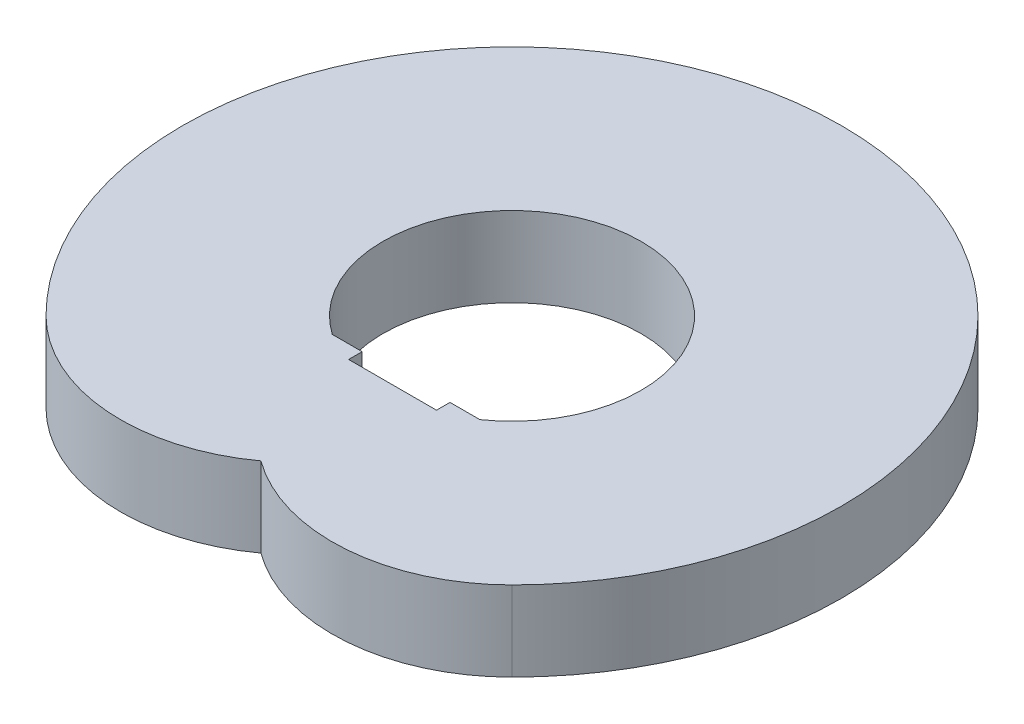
ISO-10303-21;
HEADER;
FILE_DESCRIPTION(('STEP AP214'),'2;1');
FILE_NAME('part.step','',(''),(''),'','','');
FILE_SCHEMA(('AUTOMOTIVE_DESIGN { 1 0 10303 214 1 1 1 1 }'));
ENDSEC;
DATA;
#1=APPLICATION_CONTEXT('core data for automotive mechanical design processes');
#2=APPLICATION_PROTOCOL_DEFINITION('international standard','automotive_design',2000,#1);
#3=PRODUCT_CONTEXT('',#1,'mechanical');
#4=PRODUCT('Part','Part','',(#3));
#5=PRODUCT_RELATED_PRODUCT_CATEGORY('part','',(#4));
#6=PRODUCT_DEFINITION_FORMATION('','',#4);
#7=PRODUCT_DEFINITION_CONTEXT('part definition',#1,'design');
#8=PRODUCT_DEFINITION('design','',#6,#7);
#9=PRODUCT_DEFINITION_SHAPE('','',#8);
#10=(LENGTH_UNIT() NAMED_UNIT(*) SI_UNIT(.MILLI.,.METRE.));
#11=(NAMED_UNIT(*) PLANE_ANGLE_UNIT() SI_UNIT($,.RADIAN.));
#12=(NAMED_UNIT(*) SI_UNIT($,.STERADIAN.) SOLID_ANGLE_UNIT());
#13=UNCERTAINTY_MEASURE_WITH_UNIT(LENGTH_MEASURE(1.E-05),#10,'distance_accuracy_value','');
#14=(GEOMETRIC_REPRESENTATION_CONTEXT(3) GLOBAL_UNCERTAINTY_ASSIGNED_CONTEXT((#13)) GLOBAL_UNIT_ASSIGNED_CONTEXT((#10,
#11,#12)) REPRESENTATION_CONTEXT('',''));
#15=CARTESIAN_POINT('',(0.,0.,0.));
#16=DIRECTION('',(0.,0.,1.));
#17=DIRECTION('',(1.,0.,0.));
#18=AXIS2_PLACEMENT_3D('',#15,#16,#17);
#19=CARTESIAN_POINT('',(132.582521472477,200.,132.582521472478));
#20=DIRECTION('',(0.,1.,0.));
#21=DIRECTION('',(0.,0.,1.));
#22=AXIS2_PLACEMENT_3D('',#19,#20,#21);
#23=PLANE('',#22);
#24=CARTESIAN_POINT('',(265.165042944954,200.,265.165042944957));
#25=DIRECTION('',(0.,1.,0.));
#26=DIRECTION('',(0.,0.,1.));
#27=AXIS2_PLACEMENT_3D('',#24,#25,#26);
#28=CIRCLE('',#27,449.999999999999);
#29=CARTESIAN_POINT('',(1.83186799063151E-12,200.,628.741032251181));
#30=VERTEX_POINT('',#29);
#31=CARTESIAN_POINT('',(583.363094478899,200.,583.363094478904));
#32=VERTEX_POINT('',#31);
#33=EDGE_CURVE('E157',#30,#32,#28,.T.);
#34=ORIENTED_EDGE('',*,*,#33,.T.);
#35=CARTESIAN_POINT('',(0.,200.,0.));
#36=DIRECTION('',(0.,1.,0.));
#37=DIRECTION('',(0.,0.,1.));
#38=AXIS2_PLACEMENT_3D('',#35,#36,#37);
#39=CIRCLE('',#38,825.);
#40=CARTESIAN_POINT('',(-583.363094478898,200.,583.363094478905));
#41=VERTEX_POINT('',#40);
#42=EDGE_CURVE('E160',#32,#41,#39,.T.);
#43=ORIENTED_EDGE('',*,*,#42,.T.);
#44=CARTESIAN_POINT('',(-265.165042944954,200.,265.165042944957));
#45=DIRECTION('',(0.,1.,0.));
#46=DIRECTION('',(0.,0.,1.));
#47=AXIS2_PLACEMENT_3D('',#44,#45,#46);
#48=CIRCLE('',#47,450.);
#49=EDGE_CURVE('E163',#41,#30,#48,.T.);
#50=ORIENTED_EDGE('',*,*,#49,.T.);
#51=EDGE_LOOP('',(#34,#43,#50));
#52=FACE_BOUND('',#51,.T.);
#53=DIRECTION('',(0.,0.,1.));
#54=VECTOR('',#53,1.);
#55=CARTESIAN_POINT('',(-110.,200.,265.165042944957));
#56=LINE('',#55,#54);
#57=CARTESIAN_POINT('',(-110.,200.,265.165042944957));
#58=VERTEX_POINT('',#57);
#59=CARTESIAN_POINT('',(-110.,200.,299.));
#60=VERTEX_POINT('',#59);
#61=EDGE_CURVE('E114',#58,#60,#56,.T.);
#62=ORIENTED_EDGE('',*,*,#61,.F.);
#63=DIRECTION('',(1.,0.,0.));
#64=VECTOR('',#63,1.);
#65=CARTESIAN_POINT('',(-110.,200.,265.165042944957));
#66=LINE('',#65,#64);
#67=CARTESIAN_POINT('',(-184.834957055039,200.,265.165042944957));
#68=VERTEX_POINT('',#67);
#69=EDGE_CURVE('E106',#68,#58,#66,.T.);
#70=ORIENTED_EDGE('',*,*,#69,.F.);
#71=CARTESIAN_POINT('',(0.,200.,0.));
#72=DIRECTION('',(0.,1.,0.));
#73=DIRECTION('',(0.,0.,1.));
#74=AXIS2_PLACEMENT_3D('',#71,#72,#73);
#75=CIRCLE('',#74,323.228187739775);
#76=CARTESIAN_POINT('',(184.834957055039,200.,265.165042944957));
#77=VERTEX_POINT('',#76);
#78=EDGE_CURVE('E135',#77,#68,#75,.T.);
#79=ORIENTED_EDGE('',*,*,#78,.F.);
#80=DIRECTION('',(1.,0.,0.));
#81=VECTOR('',#80,1.);
#82=CARTESIAN_POINT('',(184.834957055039,200.,265.165042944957));
#83=LINE('',#82,#81);
#84=CARTESIAN_POINT('',(110.,200.,265.165042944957));
#85=VERTEX_POINT('',#84);
#86=EDGE_CURVE('E133',#85,#77,#83,.T.);
#87=ORIENTED_EDGE('',*,*,#86,.F.);
#88=DIRECTION('',(0.,0.,-1.));
#89=VECTOR('',#88,1.);
#90=CARTESIAN_POINT('',(110.,200.,265.165042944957));
#91=LINE('',#90,#89);
#92=CARTESIAN_POINT('',(110.,200.,299.));
#93=VERTEX_POINT('',#92);
#94=EDGE_CURVE('E129',#93,#85,#91,.T.);
#95=ORIENTED_EDGE('',*,*,#94,.F.);
#96=DIRECTION('',(1.,0.,0.));
#97=VECTOR('',#96,1.);
#98=CARTESIAN_POINT('',(-110.,200.,299.));
#99=LINE('',#98,#97);
#100=EDGE_CURVE('E127',#60,#93,#99,.T.);
#101=ORIENTED_EDGE('',*,*,#100,.F.);
#102=EDGE_LOOP('',(#62,#70,#79,#87,#95,#101));
#103=FACE_BOUND('',#102,.T.);
#104=ADVANCED_FACE('F35',(#52,#103),#23,.T.);
#105=CARTESIAN_POINT('',(132.582521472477,0.,132.582521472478));
#106=DIRECTION('',(0.,1.,0.));
#107=DIRECTION('',(0.,0.,1.));
#108=AXIS2_PLACEMENT_3D('',#105,#106,#107);
#109=PLANE('',#108);
#110=CARTESIAN_POINT('',(265.165042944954,0.,265.165042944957));
#111=DIRECTION('',(0.,1.,0.));
#112=DIRECTION('',(0.,0.,1.));
#113=AXIS2_PLACEMENT_3D('',#110,#111,#112);
#114=CIRCLE('',#113,449.999999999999);
#115=CARTESIAN_POINT('',(1.83186799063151E-12,0.,628.741032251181));
#116=VERTEX_POINT('',#115);
#117=CARTESIAN_POINT('',(583.363094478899,0.,583.363094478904));
#118=VERTEX_POINT('',#117);
#119=EDGE_CURVE('E122',#116,#118,#114,.T.);
#120=ORIENTED_EDGE('',*,*,#119,.F.);
#121=CARTESIAN_POINT('',(-265.165042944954,0.,265.165042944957));
#122=DIRECTION('',(0.,1.,0.));
#123=DIRECTION('',(0.,0.,1.));
#124=AXIS2_PLACEMENT_3D('',#121,#122,#123);
#125=CIRCLE('',#124,450.);
#126=CARTESIAN_POINT('',(-583.363094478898,0.,583.363094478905));
#127=VERTEX_POINT('',#126);
#128=EDGE_CURVE('E161',#127,#116,#125,.T.);
#129=ORIENTED_EDGE('',*,*,#128,.F.);
#130=CARTESIAN_POINT('',(0.,0.,0.));
#131=DIRECTION('',(0.,1.,0.));
#132=DIRECTION('',(0.,0.,1.));
#133=AXIS2_PLACEMENT_3D('',#130,#131,#132);
#134=CIRCLE('',#133,825.);
#135=EDGE_CURVE('E168',#118,#127,#134,.T.);
#136=ORIENTED_EDGE('',*,*,#135,.F.);
#137=EDGE_LOOP('',(#120,#129,#136));
#138=FACE_BOUND('',#137,.T.);
#139=DIRECTION('',(1.,0.,0.));
#140=VECTOR('',#139,1.);
#141=CARTESIAN_POINT('',(-110.,0.,265.165042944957));
#142=LINE('',#141,#140);
#143=CARTESIAN_POINT('',(-184.834957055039,0.,265.165042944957));
#144=VERTEX_POINT('',#143);
#145=CARTESIAN_POINT('',(-110.,0.,265.165042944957));
#146=VERTEX_POINT('',#145);
#147=EDGE_CURVE('E58',#144,#146,#142,.T.);
#148=ORIENTED_EDGE('',*,*,#147,.T.);
#149=DIRECTION('',(0.,0.,1.));
#150=VECTOR('',#149,1.);
#151=CARTESIAN_POINT('',(-110.,0.,265.165042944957));
#152=LINE('',#151,#150);
#153=CARTESIAN_POINT('',(-110.,0.,299.));
#154=VERTEX_POINT('',#153);
#155=EDGE_CURVE('E121',#146,#154,#152,.T.);
#156=ORIENTED_EDGE('',*,*,#155,.T.);
#157=DIRECTION('',(1.,0.,0.));
#158=VECTOR('',#157,1.);
#159=CARTESIAN_POINT('',(-110.,0.,299.));
#160=LINE('',#159,#158);
#161=CARTESIAN_POINT('',(110.,0.,299.));
#162=VERTEX_POINT('',#161);
#163=EDGE_CURVE('E139',#154,#162,#160,.T.);
#164=ORIENTED_EDGE('',*,*,#163,.T.);
#165=DIRECTION('',(0.,0.,-1.));
#166=VECTOR('',#165,1.);
#167=CARTESIAN_POINT('',(110.,0.,265.165042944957));
#168=LINE('',#167,#166);
#169=CARTESIAN_POINT('',(110.,0.,265.165042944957));
#170=VERTEX_POINT('',#169);
#171=EDGE_CURVE('E142',#162,#170,#168,.T.);
#172=ORIENTED_EDGE('',*,*,#171,.T.);
#173=DIRECTION('',(1.,0.,0.));
#174=VECTOR('',#173,1.);
#175=CARTESIAN_POINT('',(184.834957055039,0.,265.165042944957));
#176=LINE('',#175,#174);
#177=CARTESIAN_POINT('',(184.834957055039,0.,265.165042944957));
#178=VERTEX_POINT('',#177);
#179=EDGE_CURVE('E145',#170,#178,#176,.T.);
#180=ORIENTED_EDGE('',*,*,#179,.T.);
#181=CARTESIAN_POINT('',(0.,0.,0.));
#182=DIRECTION('',(0.,1.,0.));
#183=DIRECTION('',(0.,0.,1.));
#184=AXIS2_PLACEMENT_3D('',#181,#182,#183);
#185=CIRCLE('',#184,323.228187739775);
#186=EDGE_CURVE('E115',#178,#144,#185,.T.);
#187=ORIENTED_EDGE('',*,*,#186,.T.);
#188=EDGE_LOOP('',(#148,#156,#164,#172,#180,#187));
#189=FACE_BOUND('',#188,.T.);
#190=ADVANCED_FACE('F182',(#138,#189),#109,.F.);
#191=CARTESIAN_POINT('',(265.165042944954,200.,265.165042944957));
#192=DIRECTION('',(0.,-1.,0.));
#193=DIRECTION('',(0.,0.,-1.));
#194=AXIS2_PLACEMENT_3D('',#191,#192,#193);
#195=CYLINDRICAL_SURFACE('',#194,449.999999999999);
#196=ORIENTED_EDGE('',*,*,#119,.T.);
#197=DIRECTION('',(0.,-1.,0.));
#198=VECTOR('',#197,1.);
#199=CARTESIAN_POINT('',(583.363094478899,200.,583.363094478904));
#200=LINE('',#199,#198);
#201=EDGE_CURVE('E11',#32,#118,#200,.T.);
#202=ORIENTED_EDGE('',*,*,#201,.F.);
#203=ORIENTED_EDGE('',*,*,#33,.F.);
#204=DIRECTION('',(0.,-1.,0.));
#205=VECTOR('',#204,1.);
#206=CARTESIAN_POINT('',(1.83186799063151E-12,200.,628.741032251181));
#207=LINE('',#206,#205);
#208=EDGE_CURVE('E165',#30,#116,#207,.T.);
#209=ORIENTED_EDGE('',*,*,#208,.T.);
#210=EDGE_LOOP('',(#196,#202,#203,#209));
#211=FACE_BOUND('',#210,.T.);
#212=ADVANCED_FACE('F37',(#211),#195,.T.);
#213=CARTESIAN_POINT('',(0.,200.,0.));
#214=DIRECTION('',(0.,-1.,0.));
#215=DIRECTION('',(0.,0.,-1.));
#216=AXIS2_PLACEMENT_3D('',#213,#214,#215);
#217=CYLINDRICAL_SURFACE('',#216,825.);
#218=ORIENTED_EDGE('',*,*,#135,.T.);
#219=DIRECTION('',(0.,-1.,0.));
#220=VECTOR('',#219,1.);
#221=CARTESIAN_POINT('',(-583.363094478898,200.,583.363094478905));
#222=LINE('',#221,#220);
#223=EDGE_CURVE('E43',#41,#127,#222,.T.);
#224=ORIENTED_EDGE('',*,*,#223,.F.);
#225=ORIENTED_EDGE('',*,*,#42,.F.);
#226=ORIENTED_EDGE('',*,*,#201,.T.);
#227=EDGE_LOOP('',(#218,#224,#225,#226));
#228=FACE_BOUND('',#227,.T.);
#229=ADVANCED_FACE('F188',(#228),#217,.T.);
#230=CARTESIAN_POINT('',(-265.165042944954,200.,265.165042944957));
#231=DIRECTION('',(0.,-1.,0.));
#232=DIRECTION('',(0.,0.,-1.));
#233=AXIS2_PLACEMENT_3D('',#230,#231,#232);
#234=CYLINDRICAL_SURFACE('',#233,450.);
#235=ORIENTED_EDGE('',*,*,#128,.T.);
#236=ORIENTED_EDGE('',*,*,#208,.F.);
#237=ORIENTED_EDGE('',*,*,#49,.F.);
#238=ORIENTED_EDGE('',*,*,#223,.T.);
#239=EDGE_LOOP('',(#235,#236,#237,#238));
#240=FACE_BOUND('',#239,.T.);
#241=ADVANCED_FACE('F177',(#240),#234,.T.);
#242=CARTESIAN_POINT('',(-110.,200.,265.165042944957));
#243=DIRECTION('',(0.,0.,-1.));
#244=DIRECTION('',(-1.,0.,0.));
#245=AXIS2_PLACEMENT_3D('',#242,#243,#244);
#246=PLANE('',#245);
#247=ORIENTED_EDGE('',*,*,#147,.F.);
#248=DIRECTION('',(0.,-1.,0.));
#249=VECTOR('',#248,1.);
#250=CARTESIAN_POINT('',(-184.834957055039,200.,265.165042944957));
#251=LINE('',#250,#249);
#252=EDGE_CURVE('E110',#68,#144,#251,.T.);
#253=ORIENTED_EDGE('',*,*,#252,.F.);
#254=ORIENTED_EDGE('',*,*,#69,.T.);
#255=DIRECTION('',(0.,-1.,0.));
#256=VECTOR('',#255,1.);
#257=CARTESIAN_POINT('',(-110.,200.,265.165042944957));
#258=LINE('',#257,#256);
#259=EDGE_CURVE('E109',#58,#146,#258,.T.);
#260=ORIENTED_EDGE('',*,*,#259,.T.);
#261=EDGE_LOOP('',(#247,#253,#254,#260));
#262=FACE_BOUND('',#261,.T.);
#263=ADVANCED_FACE('F108',(#262),#246,.T.);
#264=CARTESIAN_POINT('',(-110.,200.,265.165042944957));
#265=DIRECTION('',(1.,0.,0.));
#266=DIRECTION('',(0.,0.,-1.));
#267=AXIS2_PLACEMENT_3D('',#264,#265,#266);
#268=PLANE('',#267);
#269=ORIENTED_EDGE('',*,*,#155,.F.);
#270=ORIENTED_EDGE('',*,*,#259,.F.);
#271=ORIENTED_EDGE('',*,*,#61,.T.);
#272=DIRECTION('',(0.,-1.,0.));
#273=VECTOR('',#272,1.);
#274=CARTESIAN_POINT('',(-110.,200.,299.));
#275=LINE('',#274,#273);
#276=EDGE_CURVE('E123',#60,#154,#275,.T.);
#277=ORIENTED_EDGE('',*,*,#276,.T.);
#278=EDGE_LOOP('',(#269,#270,#271,#277));
#279=FACE_BOUND('',#278,.T.);
#280=ADVANCED_FACE('F118',(#279),#268,.T.);
#281=CARTESIAN_POINT('',(-110.,200.,299.));
#282=DIRECTION('',(0.,0.,-1.));
#283=DIRECTION('',(-1.,0.,0.));
#284=AXIS2_PLACEMENT_3D('',#281,#282,#283);
#285=PLANE('',#284);
#286=ORIENTED_EDGE('',*,*,#163,.F.);
#287=ORIENTED_EDGE('',*,*,#276,.F.);
#288=ORIENTED_EDGE('',*,*,#100,.T.);
#289=DIRECTION('',(0.,-1.,0.));
#290=VECTOR('',#289,1.);
#291=CARTESIAN_POINT('',(110.,200.,299.));
#292=LINE('',#291,#290);
#293=EDGE_CURVE('E154',#93,#162,#292,.T.);
#294=ORIENTED_EDGE('',*,*,#293,.T.);
#295=EDGE_LOOP('',(#286,#287,#288,#294));
#296=FACE_BOUND('',#295,.T.);
#297=ADVANCED_FACE('F206',(#296),#285,.T.);
#298=CARTESIAN_POINT('',(110.,200.,265.165042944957));
#299=DIRECTION('',(-1.,0.,0.));
#300=DIRECTION('',(0.,0.,1.));
#301=AXIS2_PLACEMENT_3D('',#298,#299,#300);
#302=PLANE('',#301);
#303=ORIENTED_EDGE('',*,*,#171,.F.);
#304=ORIENTED_EDGE('',*,*,#293,.F.);
#305=ORIENTED_EDGE('',*,*,#94,.T.);
#306=DIRECTION('',(0.,-1.,0.));
#307=VECTOR('',#306,1.);
#308=CARTESIAN_POINT('',(110.,200.,265.165042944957));
#309=LINE('',#308,#307);
#310=EDGE_CURVE('E152',#85,#170,#309,.T.);
#311=ORIENTED_EDGE('',*,*,#310,.T.);
#312=EDGE_LOOP('',(#303,#304,#305,#311));
#313=FACE_BOUND('',#312,.T.);
#314=ADVANCED_FACE('F209',(#313),#302,.T.);
#315=CARTESIAN_POINT('',(184.834957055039,200.,265.165042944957));
#316=DIRECTION('',(0.,0.,-1.));
#317=DIRECTION('',(-1.,0.,0.));
#318=AXIS2_PLACEMENT_3D('',#315,#316,#317);
#319=PLANE('',#318);
#320=ORIENTED_EDGE('',*,*,#179,.F.);
#321=ORIENTED_EDGE('',*,*,#310,.F.);
#322=ORIENTED_EDGE('',*,*,#86,.T.);
#323=DIRECTION('',(0.,-1.,0.));
#324=VECTOR('',#323,1.);
#325=CARTESIAN_POINT('',(184.834957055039,200.,265.165042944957));
#326=LINE('',#325,#324);
#327=EDGE_CURVE('E50',#77,#178,#326,.T.);
#328=ORIENTED_EDGE('',*,*,#327,.T.);
#329=EDGE_LOOP('',(#320,#321,#322,#328));
#330=FACE_BOUND('',#329,.T.);
#331=ADVANCED_FACE('F213',(#330),#319,.T.);
#332=CARTESIAN_POINT('',(0.,200.,0.));
#333=DIRECTION('',(0.,-1.,0.));
#334=DIRECTION('',(0.,0.,-1.));
#335=AXIS2_PLACEMENT_3D('',#332,#333,#334);
#336=CYLINDRICAL_SURFACE('',#335,323.228187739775);
#337=ORIENTED_EDGE('',*,*,#186,.F.);
#338=ORIENTED_EDGE('',*,*,#327,.F.);
#339=ORIENTED_EDGE('',*,*,#78,.T.);
#340=ORIENTED_EDGE('',*,*,#252,.T.);
#341=EDGE_LOOP('',(#337,#338,#339,#340));
#342=FACE_BOUND('',#341,.T.);
#343=ADVANCED_FACE('F217',(#342),#336,.F.);
#344=CLOSED_SHELL('',(#104,#190,#212,#229,#241,#263,#280,#297,#314,#331,#343));
#345=MANIFOLD_SOLID_BREP('B2',#344);
#346=ADVANCED_BREP_SHAPE_REPRESENTATION('',(#18,#345),#14);
#347=SHAPE_DEFINITION_REPRESENTATION(#9,#346);
ENDSEC;
END-ISO-10303-21;
